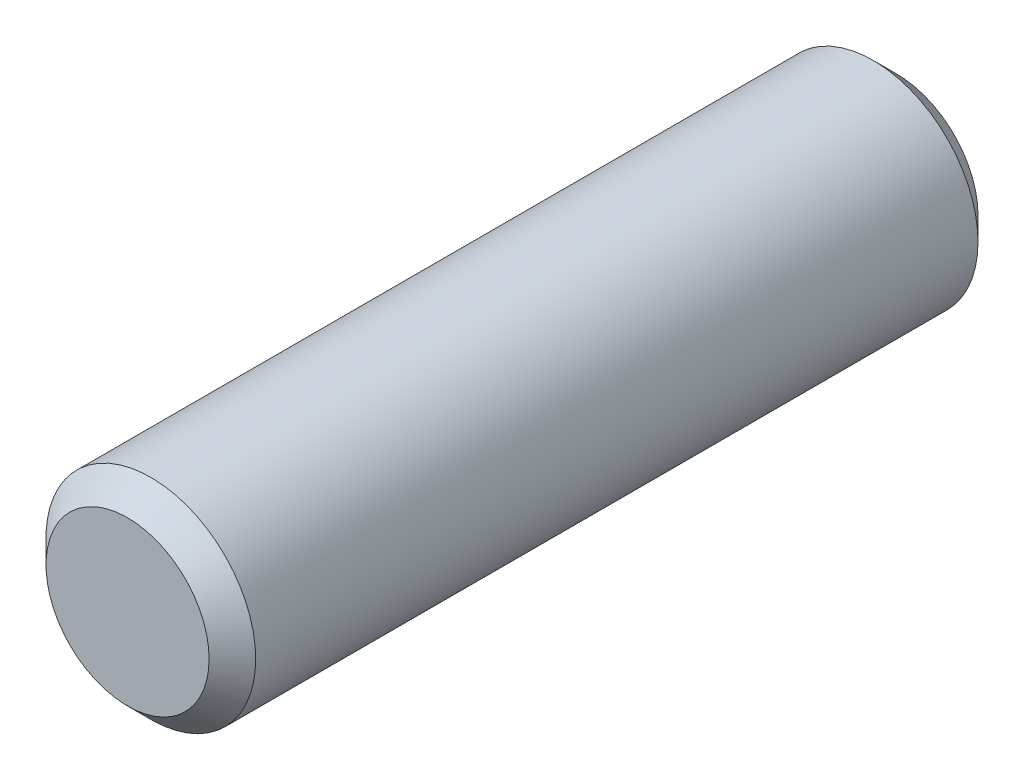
from build123d import *

# Parameters (mm, degrees)
ESQUISSE1_R          = 4.5
BASE_EXTRUSION_DEPTH = 16.5
CHANFREIN1_SIZE      = 1


with BuildPart() as part:
    # Esquisse1 → Base-Extrusion (new, symmetric)
    with BuildSketch(Plane.XY):
        Circle(ESQUISSE1_R)
    extrude(amount=BASE_EXTRUSION_DEPTH, both=True)

    # Chanfrein1
    chanfrein1_edges = [part.edges().sort_by_distance(p)[0] for p in [
        (-4.5, 0, -16.5),
        (-4.5, 0, 16.5),
    ]]
    chamfer(chanfrein1_edges, length=CHANFREIN1_SIZE)


solid = part.part
